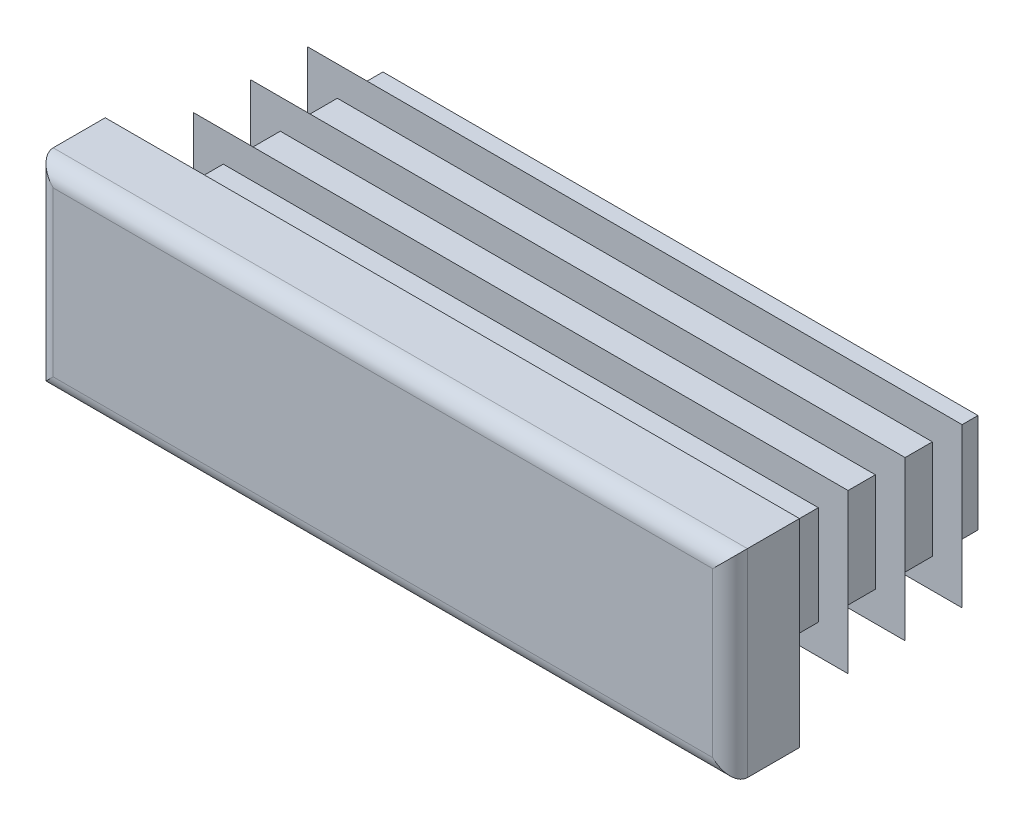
ISO-10303-21;
HEADER;
FILE_DESCRIPTION(('STEP AP214'),'2;1');
FILE_NAME('part.step','',(''),(''),'','','');
FILE_SCHEMA(('AUTOMOTIVE_DESIGN { 1 0 10303 214 1 1 1 1 }'));
ENDSEC;
DATA;
#1=APPLICATION_CONTEXT('core data for automotive mechanical design processes');
#2=APPLICATION_PROTOCOL_DEFINITION('international standard','automotive_design',2000,#1);
#3=PRODUCT_CONTEXT('',#1,'mechanical');
#4=PRODUCT('Part','Part','',(#3));
#5=PRODUCT_RELATED_PRODUCT_CATEGORY('part','',(#4));
#6=PRODUCT_DEFINITION_FORMATION('','',#4);
#7=PRODUCT_DEFINITION_CONTEXT('part definition',#1,'design');
#8=PRODUCT_DEFINITION('design','',#6,#7);
#9=PRODUCT_DEFINITION_SHAPE('','',#8);
#10=(LENGTH_UNIT() NAMED_UNIT(*) SI_UNIT(.MILLI.,.METRE.));
#11=(NAMED_UNIT(*) PLANE_ANGLE_UNIT() SI_UNIT($,.RADIAN.));
#12=(NAMED_UNIT(*) SI_UNIT($,.STERADIAN.) SOLID_ANGLE_UNIT());
#13=UNCERTAINTY_MEASURE_WITH_UNIT(LENGTH_MEASURE(1.E-05),#10,'distance_accuracy_value','');
#14=(GEOMETRIC_REPRESENTATION_CONTEXT(3) GLOBAL_UNCERTAINTY_ASSIGNED_CONTEXT((#13)) GLOBAL_UNIT_ASSIGNED_CONTEXT((#10,
#11,#12)) REPRESENTATION_CONTEXT('',''));
#15=CARTESIAN_POINT('',(0.,0.,0.));
#16=DIRECTION('',(0.,0.,1.));
#17=DIRECTION('',(1.,0.,0.));
#18=AXIS2_PLACEMENT_3D('',#15,#16,#17);
#19=CARTESIAN_POINT('',(16.625,-5.,3.5));
#20=DIRECTION('',(0.,0.,-1.));
#21=DIRECTION('',(0.,1.,0.));
#22=AXIS2_PLACEMENT_3D('',#19,#20,#21);
#23=PLANE('',#22);
#24=DIRECTION('',(0.,1.,0.));
#25=VECTOR('',#24,1.);
#26=CARTESIAN_POINT('',(-16.625,-5.,3.5));
#27=LINE('',#26,#25);
#28=CARTESIAN_POINT('',(-16.625,-4.125,3.5));
#29=VERTEX_POINT('',#28);
#30=CARTESIAN_POINT('',(-16.625,4.125,3.5));
#31=VERTEX_POINT('',#30);
#32=EDGE_CURVE('E310',#29,#31,#27,.T.);
#33=ORIENTED_EDGE('',*,*,#32,.F.);
#34=DIRECTION('',(-1.,0.,0.));
#35=VECTOR('',#34,1.);
#36=CARTESIAN_POINT('',(17.5,-4.125,3.5));
#37=LINE('',#36,#35);
#38=CARTESIAN_POINT('',(16.625,-4.125,3.5));
#39=VERTEX_POINT('',#38);
#40=EDGE_CURVE('E482',#39,#29,#37,.T.);
#41=ORIENTED_EDGE('',*,*,#40,.F.);
#42=DIRECTION('',(0.,1.,0.));
#43=VECTOR('',#42,1.);
#44=CARTESIAN_POINT('',(16.625,-5.,3.5));
#45=LINE('',#44,#43);
#46=CARTESIAN_POINT('',(16.625,4.125,3.5));
#47=VERTEX_POINT('',#46);
#48=EDGE_CURVE('E305',#39,#47,#45,.T.);
#49=ORIENTED_EDGE('',*,*,#48,.T.);
#50=DIRECTION('',(-1.,0.,0.));
#51=VECTOR('',#50,1.);
#52=CARTESIAN_POINT('',(17.5,4.125,3.5));
#53=LINE('',#52,#51);
#54=EDGE_CURVE('E630',#47,#31,#53,.T.);
#55=ORIENTED_EDGE('',*,*,#54,.T.);
#56=EDGE_LOOP('',(#33,#41,#49,#55));
#57=FACE_BOUND('',#56,.T.);
#58=ADVANCED_FACE('F14',(#57),#23,.F.);
#59=CARTESIAN_POINT('',(-16.625,-5.,2.625));
#60=DIRECTION('',(0.,1.,0.));
#61=DIRECTION('',(-1.,0.,0.));
#62=AXIS2_PLACEMENT_3D('',#59,#60,#61);
#63=CYLINDRICAL_SURFACE('',#62,0.875);
#64=DIRECTION('',(0.,1.,0.));
#65=VECTOR('',#64,1.);
#66=CARTESIAN_POINT('',(-17.5,-5.,2.625));
#67=LINE('',#66,#65);
#68=CARTESIAN_POINT('',(-17.5,-5.,2.625));
#69=VERTEX_POINT('',#68);
#70=CARTESIAN_POINT('',(-17.5,5.,2.625));
#71=VERTEX_POINT('',#70);
#72=EDGE_CURVE('E402',#69,#71,#67,.T.);
#73=ORIENTED_EDGE('',*,*,#72,.F.);
#74=CARTESIAN_POINT('',(-16.625,-4.125,2.625));
#75=DIRECTION('',(-0.707106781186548,0.707106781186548,0.));
#76=DIRECTION('',(0.707106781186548,0.707106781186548,0.));
#77=AXIS2_PLACEMENT_3D('',#74,#75,#76);
#78=ELLIPSE('',#77,1.23743686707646,0.875);
#79=EDGE_CURVE('E59',#69,#29,#78,.T.);
#80=ORIENTED_EDGE('',*,*,#79,.T.);
#81=ORIENTED_EDGE('',*,*,#32,.T.);
#82=CARTESIAN_POINT('',(-16.625,4.125,2.625));
#83=DIRECTION('',(0.707106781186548,0.707106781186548,0.));
#84=DIRECTION('',(-0.707106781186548,0.707106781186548,0.));
#85=AXIS2_PLACEMENT_3D('',#82,#83,#84);
#86=ELLIPSE('',#85,1.23743686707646,0.875);
#87=EDGE_CURVE('E306',#31,#71,#86,.F.);
#88=ORIENTED_EDGE('',*,*,#87,.T.);
#89=EDGE_LOOP('',(#73,#80,#81,#88));
#90=FACE_BOUND('',#89,.T.);
#91=ADVANCED_FACE('F16',(#90),#63,.T.);
#92=CARTESIAN_POINT('',(-17.5,-5.,2.625));
#93=DIRECTION('',(1.,0.,0.));
#94=DIRECTION('',(0.,1.,0.));
#95=AXIS2_PLACEMENT_3D('',#92,#93,#94);
#96=PLANE('',#95);
#97=DIRECTION('',(0.,0.,-1.));
#98=VECTOR('',#97,1.);
#99=CARTESIAN_POINT('',(-17.5,5.,2.625));
#100=LINE('',#99,#98);
#101=CARTESIAN_POINT('',(-17.5,5.,0.));
#102=VERTEX_POINT('',#101);
#103=EDGE_CURVE('E615',#71,#102,#100,.T.);
#104=ORIENTED_EDGE('',*,*,#103,.T.);
#105=DIRECTION('',(0.,1.,0.));
#106=VECTOR('',#105,1.);
#107=CARTESIAN_POINT('',(-17.5,-5.,0.));
#108=LINE('',#107,#106);
#109=CARTESIAN_POINT('',(-17.5,-5.,0.));
#110=VERTEX_POINT('',#109);
#111=EDGE_CURVE('E400',#110,#102,#108,.T.);
#112=ORIENTED_EDGE('',*,*,#111,.F.);
#113=DIRECTION('',(0.,0.,-1.));
#114=VECTOR('',#113,1.);
#115=CARTESIAN_POINT('',(-17.5,-5.,2.625));
#116=LINE('',#115,#114);
#117=EDGE_CURVE('E616',#69,#110,#116,.T.);
#118=ORIENTED_EDGE('',*,*,#117,.F.);
#119=ORIENTED_EDGE('',*,*,#72,.T.);
#120=EDGE_LOOP('',(#104,#112,#118,#119));
#121=FACE_BOUND('',#120,.T.);
#122=ADVANCED_FACE('F697',(#121),#96,.F.);
#123=CARTESIAN_POINT('',(-15.,-5.,0.));
#124=DIRECTION('',(1.,0.,0.));
#125=DIRECTION('',(0.,1.,0.));
#126=AXIS2_PLACEMENT_3D('',#123,#124,#125);
#127=PLANE('',#126);
#128=DIRECTION('',(0.,1.,0.));
#129=VECTOR('',#128,1.);
#130=CARTESIAN_POINT('',(-15.,-5.,0.));
#131=LINE('',#130,#129);
#132=CARTESIAN_POINT('',(-15.,-2.5,0.));
#133=VERTEX_POINT('',#132);
#134=CARTESIAN_POINT('',(-15.,2.5,0.));
#135=VERTEX_POINT('',#134);
#136=EDGE_CURVE('E397',#133,#135,#131,.T.);
#137=ORIENTED_EDGE('',*,*,#136,.T.);
#138=DIRECTION('',(0.,0.,-1.));
#139=VECTOR('',#138,1.);
#140=CARTESIAN_POINT('',(-15.,2.5,0.));
#141=LINE('',#140,#139);
#142=CARTESIAN_POINT('',(-15.,2.5,-0.575));
#143=VERTEX_POINT('',#142);
#144=EDGE_CURVE('E495',#135,#143,#141,.T.);
#145=ORIENTED_EDGE('',*,*,#144,.T.);
#146=DIRECTION('',(0.,1.,0.));
#147=VECTOR('',#146,1.);
#148=CARTESIAN_POINT('',(-15.,-5.,-0.575));
#149=LINE('',#148,#147);
#150=CARTESIAN_POINT('',(-15.,-2.5,-0.575));
#151=VERTEX_POINT('',#150);
#152=EDGE_CURVE('E394',#151,#143,#149,.T.);
#153=ORIENTED_EDGE('',*,*,#152,.F.);
#154=DIRECTION('',(0.,0.,1.));
#155=VECTOR('',#154,1.);
#156=CARTESIAN_POINT('',(-15.,-2.5,0.));
#157=LINE('',#156,#155);
#158=EDGE_CURVE('E489',#151,#133,#157,.T.);
#159=ORIENTED_EDGE('',*,*,#158,.T.);
#160=EDGE_LOOP('',(#137,#145,#153,#159));
#161=FACE_BOUND('',#160,.T.);
#162=ADVANCED_FACE('F787',(#161),#127,.F.);
#163=CARTESIAN_POINT('',(-16.5,-5.,-0.575));
#164=DIRECTION('',(0.342020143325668,0.,0.939692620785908));
#165=DIRECTION('',(-0.939692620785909,0.,0.342020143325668));
#166=AXIS2_PLACEMENT_3D('',#163,#164,#165);
#167=PLANE('',#166);
#168=DIRECTION('',(0.,1.,0.));
#169=VECTOR('',#168,1.);
#170=CARTESIAN_POINT('',(-16.5,-5.,-0.575));
#171=LINE('',#170,#169);
#172=CARTESIAN_POINT('',(-16.5,-4.,-0.575));
#173=VERTEX_POINT('',#172);
#174=CARTESIAN_POINT('',(-16.5,4.,-0.575));
#175=VERTEX_POINT('',#174);
#176=EDGE_CURVE('E392',#173,#175,#171,.T.);
#177=ORIENTED_EDGE('',*,*,#176,.T.);
#178=DIRECTION('',(0.844349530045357,-0.438895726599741,-0.307318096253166));
#179=VECTOR('',#178,1.);
#180=CARTESIAN_POINT('',(-13.1647673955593,2.26633487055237,-1.78892539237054));
#181=LINE('',#180,#179);
#182=CARTESIAN_POINT('',(-15.,3.22029495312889,-1.1209553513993));
#183=VERTEX_POINT('',#182);
#184=EDGE_CURVE('E519',#175,#183,#181,.T.);
#185=ORIENTED_EDGE('',*,*,#184,.T.);
#186=DIRECTION('',(0.,1.,0.));
#187=VECTOR('',#186,1.);
#188=CARTESIAN_POINT('',(-15.,-5.,-1.1209553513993));
#189=LINE('',#188,#187);
#190=CARTESIAN_POINT('',(-15.,-3.22029495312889,-1.1209553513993));
#191=VERTEX_POINT('',#190);
#192=EDGE_CURVE('E389',#191,#183,#189,.T.);
#193=ORIENTED_EDGE('',*,*,#192,.F.);
#194=DIRECTION('',(-0.844349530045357,-0.438895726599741,0.307318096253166));
#195=VECTOR('',#194,1.);
#196=CARTESIAN_POINT('',(-16.8705814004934,-4.19262945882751,-0.440119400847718));
#197=LINE('',#196,#195);
#198=EDGE_CURVE('E507',#191,#173,#197,.T.);
#199=ORIENTED_EDGE('',*,*,#198,.T.);
#200=EDGE_LOOP('',(#177,#185,#193,#199));
#201=FACE_BOUND('',#200,.T.);
#202=ADVANCED_FACE('F783',(#201),#167,.F.);
#203=CARTESIAN_POINT('',(-15.,-5.,-1.1209553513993));
#204=DIRECTION('',(1.,0.,0.));
#205=DIRECTION('',(0.,1.,0.));
#206=AXIS2_PLACEMENT_3D('',#203,#204,#205);
#207=PLANE('',#206);
#208=ORIENTED_EDGE('',*,*,#192,.T.);
#209=DIRECTION('',(0.,-0.819152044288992,-0.573576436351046));
#210=VECTOR('',#209,1.);
#211=CARTESIAN_POINT('',(-15.,-2.29560575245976,-4.98323060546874));
#212=LINE('',#211,#210);
#213=CARTESIAN_POINT('',(-15.,2.5,-1.62531130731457));
#214=VERTEX_POINT('',#213);
#215=EDGE_CURVE('E516',#183,#214,#212,.T.);
#216=ORIENTED_EDGE('',*,*,#215,.T.);
#217=DIRECTION('',(0.,0.,-1.));
#218=VECTOR('',#217,1.);
#219=CARTESIAN_POINT('',(-15.,2.5,-1.1209553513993));
#220=LINE('',#219,#218);
#221=CARTESIAN_POINT('',(-15.,2.5,-3.45));
#222=VERTEX_POINT('',#221);
#223=EDGE_CURVE('E525',#214,#222,#220,.T.);
#224=ORIENTED_EDGE('',*,*,#223,.T.);
#225=DIRECTION('',(0.,1.,0.));
#226=VECTOR('',#225,1.);
#227=CARTESIAN_POINT('',(-15.,-5.,-3.45));
#228=LINE('',#227,#226);
#229=CARTESIAN_POINT('',(-15.,-2.5,-3.45));
#230=VERTEX_POINT('',#229);
#231=EDGE_CURVE('E386',#230,#222,#228,.T.);
#232=ORIENTED_EDGE('',*,*,#231,.F.);
#233=DIRECTION('',(0.,0.,1.));
#234=VECTOR('',#233,1.);
#235=CARTESIAN_POINT('',(-15.,-2.5,-1.1209553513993));
#236=LINE('',#235,#234);
#237=CARTESIAN_POINT('',(-15.,-2.5,-1.62531130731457));
#238=VERTEX_POINT('',#237);
#239=EDGE_CURVE('E522',#230,#238,#236,.T.);
#240=ORIENTED_EDGE('',*,*,#239,.T.);
#241=DIRECTION('',(0.,-0.819152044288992,0.573576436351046));
#242=VECTOR('',#241,1.);
#243=CARTESIAN_POINT('',(-15.,-4.41449496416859,-0.284767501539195));
#244=LINE('',#243,#242);
#245=EDGE_CURVE('E504',#238,#191,#244,.T.);
#246=ORIENTED_EDGE('',*,*,#245,.T.);
#247=EDGE_LOOP('',(#208,#216,#224,#232,#240,#246));
#248=FACE_BOUND('',#247,.T.);
#249=ADVANCED_FACE('F779',(#248),#207,.F.);
#250=CARTESIAN_POINT('',(-16.5,-5.,-3.45));
#251=DIRECTION('',(0.342020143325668,0.,0.939692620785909));
#252=DIRECTION('',(-0.939692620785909,0.,0.342020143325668));
#253=AXIS2_PLACEMENT_3D('',#250,#251,#252);
#254=PLANE('',#253);
#255=DIRECTION('',(0.,1.,0.));
#256=VECTOR('',#255,1.);
#257=CARTESIAN_POINT('',(-16.5,-5.,-3.45));
#258=LINE('',#257,#256);
#259=CARTESIAN_POINT('',(-16.5,-4.,-3.45));
#260=VERTEX_POINT('',#259);
#261=CARTESIAN_POINT('',(-16.5,4.,-3.45));
#262=VERTEX_POINT('',#261);
#263=EDGE_CURVE('E384',#260,#262,#258,.T.);
#264=ORIENTED_EDGE('',*,*,#263,.T.);
#265=DIRECTION('',(0.844349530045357,-0.43889572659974,-0.307318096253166));
#266=VECTOR('',#265,1.);
#267=CARTESIAN_POINT('',(-13.1647673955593,2.26633487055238,-4.66392539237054));
#268=LINE('',#267,#266);
#269=CARTESIAN_POINT('',(-15.,3.22029495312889,-3.99595535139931));
#270=VERTEX_POINT('',#269);
#271=EDGE_CURVE('E549',#262,#270,#268,.T.);
#272=ORIENTED_EDGE('',*,*,#271,.T.);
#273=DIRECTION('',(0.,1.,0.));
#274=VECTOR('',#273,1.);
#275=CARTESIAN_POINT('',(-15.,-5.,-3.99595535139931));
#276=LINE('',#275,#274);
#277=CARTESIAN_POINT('',(-15.,-3.22029495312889,-3.99595535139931));
#278=VERTEX_POINT('',#277);
#279=EDGE_CURVE('E381',#278,#270,#276,.T.);
#280=ORIENTED_EDGE('',*,*,#279,.F.);
#281=DIRECTION('',(-0.844349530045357,-0.43889572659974,0.307318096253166));
#282=VECTOR('',#281,1.);
#283=CARTESIAN_POINT('',(-16.8705814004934,-4.19262945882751,-3.31511940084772));
#284=LINE('',#283,#282);
#285=EDGE_CURVE('E537',#278,#260,#284,.T.);
#286=ORIENTED_EDGE('',*,*,#285,.T.);
#287=EDGE_LOOP('',(#264,#272,#280,#286));
#288=FACE_BOUND('',#287,.T.);
#289=ADVANCED_FACE('F775',(#288),#254,.F.);
#290=CARTESIAN_POINT('',(-15.,-5.,-3.99595535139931));
#291=DIRECTION('',(1.,0.,0.));
#292=DIRECTION('',(0.,1.,0.));
#293=AXIS2_PLACEMENT_3D('',#290,#291,#292);
#294=PLANE('',#293);
#295=ORIENTED_EDGE('',*,*,#279,.T.);
#296=DIRECTION('',(0.,-0.819152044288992,-0.573576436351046));
#297=VECTOR('',#296,1.);
#298=CARTESIAN_POINT('',(-15.,-2.29560575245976,-7.85823060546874));
#299=LINE('',#298,#297);
#300=CARTESIAN_POINT('',(-15.,2.5,-4.50031130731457));
#301=VERTEX_POINT('',#300);
#302=EDGE_CURVE('E546',#270,#301,#299,.T.);
#303=ORIENTED_EDGE('',*,*,#302,.T.);
#304=DIRECTION('',(0.,0.,-1.));
#305=VECTOR('',#304,1.);
#306=CARTESIAN_POINT('',(-15.,2.5,-3.99595535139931));
#307=LINE('',#306,#305);
#308=CARTESIAN_POINT('',(-15.,2.5,-6.325));
#309=VERTEX_POINT('',#308);
#310=EDGE_CURVE('E555',#301,#309,#307,.T.);
#311=ORIENTED_EDGE('',*,*,#310,.T.);
#312=DIRECTION('',(0.,1.,0.));
#313=VECTOR('',#312,1.);
#314=CARTESIAN_POINT('',(-15.,-5.,-6.325));
#315=LINE('',#314,#313);
#316=CARTESIAN_POINT('',(-15.,-2.5,-6.325));
#317=VERTEX_POINT('',#316);
#318=EDGE_CURVE('E378',#317,#309,#315,.T.);
#319=ORIENTED_EDGE('',*,*,#318,.F.);
#320=DIRECTION('',(0.,0.,1.));
#321=VECTOR('',#320,1.);
#322=CARTESIAN_POINT('',(-15.,-2.5,-3.99595535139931));
#323=LINE('',#322,#321);
#324=CARTESIAN_POINT('',(-15.,-2.5,-4.50031130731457));
#325=VERTEX_POINT('',#324);
#326=EDGE_CURVE('E552',#317,#325,#323,.T.);
#327=ORIENTED_EDGE('',*,*,#326,.T.);
#328=DIRECTION('',(0.,-0.819152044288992,0.573576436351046));
#329=VECTOR('',#328,1.);
#330=CARTESIAN_POINT('',(-15.,-4.41449496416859,-3.1597675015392));
#331=LINE('',#330,#329);
#332=EDGE_CURVE('E534',#325,#278,#331,.T.);
#333=ORIENTED_EDGE('',*,*,#332,.T.);
#334=EDGE_LOOP('',(#295,#303,#311,#319,#327,#333));
#335=FACE_BOUND('',#334,.T.);
#336=ADVANCED_FACE('F771',(#335),#294,.F.);
#337=CARTESIAN_POINT('',(-16.5,-5.,-6.325));
#338=DIRECTION('',(0.342020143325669,0.,0.939692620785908));
#339=DIRECTION('',(-0.939692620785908,0.,0.342020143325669));
#340=AXIS2_PLACEMENT_3D('',#337,#338,#339);
#341=PLANE('',#340);
#342=DIRECTION('',(0.,1.,0.));
#343=VECTOR('',#342,1.);
#344=CARTESIAN_POINT('',(-16.5,-5.,-6.325));
#345=LINE('',#344,#343);
#346=CARTESIAN_POINT('',(-16.5,-4.,-6.325));
#347=VERTEX_POINT('',#346);
#348=CARTESIAN_POINT('',(-16.5,4.,-6.325));
#349=VERTEX_POINT('',#348);
#350=EDGE_CURVE('E376',#347,#349,#345,.T.);
#351=ORIENTED_EDGE('',*,*,#350,.T.);
#352=DIRECTION('',(0.844349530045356,-0.438895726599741,-0.307318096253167));
#353=VECTOR('',#352,1.);
#354=CARTESIAN_POINT('',(-13.1647673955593,2.26633487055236,-7.53892539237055));
#355=LINE('',#354,#353);
#356=CARTESIAN_POINT('',(-15.,3.22029495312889,-6.87095535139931));
#357=VERTEX_POINT('',#356);
#358=EDGE_CURVE('E579',#349,#357,#355,.T.);
#359=ORIENTED_EDGE('',*,*,#358,.T.);
#360=DIRECTION('',(0.,1.,0.));
#361=VECTOR('',#360,1.);
#362=CARTESIAN_POINT('',(-15.,-5.,-6.87095535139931));
#363=LINE('',#362,#361);
#364=CARTESIAN_POINT('',(-15.,-3.22029495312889,-6.87095535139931));
#365=VERTEX_POINT('',#364);
#366=EDGE_CURVE('E373',#365,#357,#363,.T.);
#367=ORIENTED_EDGE('',*,*,#366,.F.);
#368=DIRECTION('',(-0.844349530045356,-0.438895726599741,0.307318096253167));
#369=VECTOR('',#368,1.);
#370=CARTESIAN_POINT('',(-16.8705814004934,-4.19262945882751,-6.19011940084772));
#371=LINE('',#370,#369);
#372=EDGE_CURVE('E567',#365,#347,#371,.T.);
#373=ORIENTED_EDGE('',*,*,#372,.T.);
#374=EDGE_LOOP('',(#351,#359,#367,#373));
#375=FACE_BOUND('',#374,.T.);
#376=ADVANCED_FACE('F767',(#375),#341,.F.);
#377=CARTESIAN_POINT('',(-15.,-5.,-6.87095535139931));
#378=DIRECTION('',(1.,0.,0.));
#379=DIRECTION('',(0.,1.,0.));
#380=AXIS2_PLACEMENT_3D('',#377,#378,#379);
#381=PLANE('',#380);
#382=ORIENTED_EDGE('',*,*,#366,.T.);
#383=DIRECTION('',(0.,-0.819152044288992,-0.573576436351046));
#384=VECTOR('',#383,1.);
#385=CARTESIAN_POINT('',(-15.,-2.29560575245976,-10.7332306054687));
#386=LINE('',#385,#384);
#387=CARTESIAN_POINT('',(-15.,2.5,-7.37531130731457));
#388=VERTEX_POINT('',#387);
#389=EDGE_CURVE('E576',#357,#388,#386,.T.);
#390=ORIENTED_EDGE('',*,*,#389,.T.);
#391=DIRECTION('',(0.,0.,-1.));
#392=VECTOR('',#391,1.);
#393=CARTESIAN_POINT('',(-15.,2.5,-6.87095535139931));
#394=LINE('',#393,#392);
#395=CARTESIAN_POINT('',(-15.,2.5,-9.2));
#396=VERTEX_POINT('',#395);
#397=EDGE_CURVE('E585',#388,#396,#394,.T.);
#398=ORIENTED_EDGE('',*,*,#397,.T.);
#399=DIRECTION('',(0.,1.,0.));
#400=VECTOR('',#399,1.);
#401=CARTESIAN_POINT('',(-15.,-5.,-9.2));
#402=LINE('',#401,#400);
#403=CARTESIAN_POINT('',(-15.,-2.5,-9.2));
#404=VERTEX_POINT('',#403);
#405=EDGE_CURVE('E370',#404,#396,#402,.T.);
#406=ORIENTED_EDGE('',*,*,#405,.F.);
#407=DIRECTION('',(0.,0.,1.));
#408=VECTOR('',#407,1.);
#409=CARTESIAN_POINT('',(-15.,-2.5,-6.87095535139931));
#410=LINE('',#409,#408);
#411=CARTESIAN_POINT('',(-15.,-2.5,-7.37531130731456));
#412=VERTEX_POINT('',#411);
#413=EDGE_CURVE('E582',#404,#412,#410,.T.);
#414=ORIENTED_EDGE('',*,*,#413,.T.);
#415=DIRECTION('',(0.,-0.819152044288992,0.573576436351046));
#416=VECTOR('',#415,1.);
#417=CARTESIAN_POINT('',(-15.,-4.41449496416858,-6.0347675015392));
#418=LINE('',#417,#416);
#419=EDGE_CURVE('E564',#412,#365,#418,.T.);
#420=ORIENTED_EDGE('',*,*,#419,.T.);
#421=EDGE_LOOP('',(#382,#390,#398,#406,#414,#420));
#422=FACE_BOUND('',#421,.T.);
#423=ADVANCED_FACE('F764',(#422),#381,.F.);
#424=CARTESIAN_POINT('',(-16.5,-5.,-9.2));
#425=DIRECTION('',(0.34202014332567,0.,0.939692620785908));
#426=DIRECTION('',(-0.939692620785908,0.,0.34202014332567));
#427=AXIS2_PLACEMENT_3D('',#424,#425,#426);
#428=PLANE('',#427);
#429=DIRECTION('',(0.,1.,0.));
#430=VECTOR('',#429,1.);
#431=CARTESIAN_POINT('',(-16.5,-5.,-9.2));
#432=LINE('',#431,#430);
#433=CARTESIAN_POINT('',(-16.5,-4.,-9.2));
#434=VERTEX_POINT('',#433);
#435=CARTESIAN_POINT('',(-16.5,4.,-9.2));
#436=VERTEX_POINT('',#435);
#437=EDGE_CURVE('E368',#434,#436,#432,.T.);
#438=ORIENTED_EDGE('',*,*,#437,.T.);
#439=DIRECTION('',(0.844349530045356,-0.438895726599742,-0.307318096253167));
#440=VECTOR('',#439,1.);
#441=CARTESIAN_POINT('',(-13.1647673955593,2.26633487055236,-10.4139253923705));
#442=LINE('',#441,#440);
#443=CARTESIAN_POINT('',(-15.,3.22029495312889,-9.74595535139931));
#444=VERTEX_POINT('',#443);
#445=EDGE_CURVE('E607',#436,#444,#442,.T.);
#446=ORIENTED_EDGE('',*,*,#445,.T.);
#447=DIRECTION('',(0.,1.,0.));
#448=VECTOR('',#447,1.);
#449=CARTESIAN_POINT('',(-15.,-5.,-9.74595535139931));
#450=LINE('',#449,#448);
#451=CARTESIAN_POINT('',(-15.,-3.22029495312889,-9.74595535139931));
#452=VERTEX_POINT('',#451);
#453=EDGE_CURVE('E365',#452,#444,#450,.T.);
#454=ORIENTED_EDGE('',*,*,#453,.F.);
#455=DIRECTION('',(-0.844349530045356,-0.438895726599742,0.307318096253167));
#456=VECTOR('',#455,1.);
#457=CARTESIAN_POINT('',(-16.8705814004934,-4.19262945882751,-9.06511940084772));
#458=LINE('',#457,#456);
#459=EDGE_CURVE('E595',#452,#434,#458,.T.);
#460=ORIENTED_EDGE('',*,*,#459,.T.);
#461=EDGE_LOOP('',(#438,#446,#454,#460));
#462=FACE_BOUND('',#461,.T.);
#463=ADVANCED_FACE('F675',(#462),#428,.F.);
#464=CARTESIAN_POINT('',(-15.,-5.,-9.74595535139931));
#465=DIRECTION('',(1.,0.,0.));
#466=DIRECTION('',(0.,1.,0.));
#467=AXIS2_PLACEMENT_3D('',#464,#465,#466);
#468=PLANE('',#467);
#469=ORIENTED_EDGE('',*,*,#453,.T.);
#470=DIRECTION('',(0.,-0.819152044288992,-0.573576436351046));
#471=VECTOR('',#470,1.);
#472=CARTESIAN_POINT('',(-15.,-2.29560575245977,-13.6082306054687));
#473=LINE('',#472,#471);
#474=CARTESIAN_POINT('',(-15.,2.5,-10.2503113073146));
#475=VERTEX_POINT('',#474);
#476=EDGE_CURVE('E604',#444,#475,#473,.T.);
#477=ORIENTED_EDGE('',*,*,#476,.T.);
#478=DIRECTION('',(0.,0.,-1.));
#479=VECTOR('',#478,1.);
#480=CARTESIAN_POINT('',(-15.,2.5,-9.74595535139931));
#481=LINE('',#480,#479);
#482=CARTESIAN_POINT('',(-15.,2.5,-11.5));
#483=VERTEX_POINT('',#482);
#484=EDGE_CURVE('E613',#475,#483,#481,.T.);
#485=ORIENTED_EDGE('',*,*,#484,.T.);
#486=DIRECTION('',(0.,1.,0.));
#487=VECTOR('',#486,1.);
#488=CARTESIAN_POINT('',(-15.,-5.,-11.5));
#489=LINE('',#488,#487);
#490=CARTESIAN_POINT('',(-15.,-2.5,-11.5));
#491=VERTEX_POINT('',#490);
#492=EDGE_CURVE('E362',#491,#483,#489,.T.);
#493=ORIENTED_EDGE('',*,*,#492,.F.);
#494=DIRECTION('',(0.,0.,1.));
#495=VECTOR('',#494,1.);
#496=CARTESIAN_POINT('',(-15.,-2.5,-9.74595535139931));
#497=LINE('',#496,#495);
#498=CARTESIAN_POINT('',(-15.,-2.5,-10.2503113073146));
#499=VERTEX_POINT('',#498);
#500=EDGE_CURVE('E610',#491,#499,#497,.T.);
#501=ORIENTED_EDGE('',*,*,#500,.T.);
#502=DIRECTION('',(0.,-0.819152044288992,0.573576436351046));
#503=VECTOR('',#502,1.);
#504=CARTESIAN_POINT('',(-15.,-4.41449496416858,-8.9097675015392));
#505=LINE('',#504,#503);
#506=EDGE_CURVE('E592',#499,#452,#505,.T.);
#507=ORIENTED_EDGE('',*,*,#506,.T.);
#508=EDGE_LOOP('',(#469,#477,#485,#493,#501,#507));
#509=FACE_BOUND('',#508,.T.);
#510=ADVANCED_FACE('F677',(#509),#468,.F.);
#511=CARTESIAN_POINT('',(-15.,-5.,-11.5));
#512=DIRECTION('',(0.,0.,1.));
#513=DIRECTION('',(0.,-1.,0.));
#514=AXIS2_PLACEMENT_3D('',#511,#512,#513);
#515=PLANE('',#514);
#516=ORIENTED_EDGE('',*,*,#492,.T.);
#517=DIRECTION('',(-1.,0.,0.));
#518=VECTOR('',#517,1.);
#519=CARTESIAN_POINT('',(17.5,2.5,-11.5));
#520=LINE('',#519,#518);
#521=CARTESIAN_POINT('',(15.,2.5,-11.5));
#522=VERTEX_POINT('',#521);
#523=EDGE_CURVE('E438',#522,#483,#520,.T.);
#524=ORIENTED_EDGE('',*,*,#523,.F.);
#525=DIRECTION('',(0.,1.,0.));
#526=VECTOR('',#525,1.);
#527=CARTESIAN_POINT('',(15.,-5.,-11.5));
#528=LINE('',#527,#526);
#529=CARTESIAN_POINT('',(15.,-2.5,-11.5));
#530=VERTEX_POINT('',#529);
#531=EDGE_CURVE('E359',#530,#522,#528,.T.);
#532=ORIENTED_EDGE('',*,*,#531,.F.);
#533=DIRECTION('',(-1.,0.,0.));
#534=VECTOR('',#533,1.);
#535=CARTESIAN_POINT('',(17.5,-2.5,-11.5));
#536=LINE('',#535,#534);
#537=EDGE_CURVE('E436',#530,#491,#536,.T.);
#538=ORIENTED_EDGE('',*,*,#537,.T.);
#539=EDGE_LOOP('',(#516,#524,#532,#538));
#540=FACE_BOUND('',#539,.T.);
#541=ADVANCED_FACE('F435',(#540),#515,.F.);
#542=CARTESIAN_POINT('',(15.,-5.,-11.5));
#543=DIRECTION('',(-1.,0.,0.));
#544=DIRECTION('',(0.,-1.,0.));
#545=AXIS2_PLACEMENT_3D('',#542,#543,#544);
#546=PLANE('',#545);
#547=DIRECTION('',(0.,0.,1.));
#548=VECTOR('',#547,1.);
#549=CARTESIAN_POINT('',(15.,2.5,-11.5));
#550=LINE('',#549,#548);
#551=CARTESIAN_POINT('',(15.,2.5,-10.2503113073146));
#552=VERTEX_POINT('',#551);
#553=EDGE_CURVE('E9',#522,#552,#550,.T.);
#554=ORIENTED_EDGE('',*,*,#553,.T.);
#555=DIRECTION('',(0.,0.819152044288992,0.573576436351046));
#556=VECTOR('',#555,1.);
#557=CARTESIAN_POINT('',(15.,-3.11973715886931,-14.1852936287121));
#558=LINE('',#557,#556);
#559=CARTESIAN_POINT('',(15.,3.22029495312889,-9.7459553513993));
#560=VERTEX_POINT('',#559);
#561=EDGE_CURVE('E601',#552,#560,#558,.T.);
#562=ORIENTED_EDGE('',*,*,#561,.T.);
#563=DIRECTION('',(0.,1.,0.));
#564=VECTOR('',#563,1.);
#565=CARTESIAN_POINT('',(15.,-5.,-9.7459553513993));
#566=LINE('',#565,#564);
#567=CARTESIAN_POINT('',(15.,-3.22029495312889,-9.7459553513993));
#568=VERTEX_POINT('',#567);
#569=EDGE_CURVE('E356',#568,#560,#566,.T.);
#570=ORIENTED_EDGE('',*,*,#569,.F.);
#571=DIRECTION('',(0.,0.819152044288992,-0.573576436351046));
#572=VECTOR('',#571,1.);
#573=CARTESIAN_POINT('',(15.,-3.59036355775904,-9.48683052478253));
#574=LINE('',#573,#572);
#575=CARTESIAN_POINT('',(15.,-2.5,-10.2503113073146));
#576=VERTEX_POINT('',#575);
#577=EDGE_CURVE('E428',#568,#576,#574,.T.);
#578=ORIENTED_EDGE('',*,*,#577,.T.);
#579=DIRECTION('',(0.,0.,-1.));
#580=VECTOR('',#579,1.);
#581=CARTESIAN_POINT('',(15.,-2.5,-11.5));
#582=LINE('',#581,#580);
#583=EDGE_CURVE('E23',#576,#530,#582,.T.);
#584=ORIENTED_EDGE('',*,*,#583,.T.);
#585=ORIENTED_EDGE('',*,*,#531,.T.);
#586=EDGE_LOOP('',(#554,#562,#570,#578,#584,#585));
#587=FACE_BOUND('',#586,.T.);
#588=ADVANCED_FACE('F426',(#587),#546,.F.);
#589=CARTESIAN_POINT('',(15.,-5.,-9.7459553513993));
#590=DIRECTION('',(-0.342020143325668,0.,0.939692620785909));
#591=DIRECTION('',(-0.939692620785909,0.,-0.342020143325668));
#592=AXIS2_PLACEMENT_3D('',#589,#590,#591);
#593=PLANE('',#592);
#594=ORIENTED_EDGE('',*,*,#569,.T.);
#595=DIRECTION('',(0.844349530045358,0.43889572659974,0.307318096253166));
#596=VECTOR('',#595,1.);
#597=CARTESIAN_POINT('',(11.9537115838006,1.63682398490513,-10.8547136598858));
#598=LINE('',#597,#596);
#599=CARTESIAN_POINT('',(16.5,4.,-9.2));
#600=VERTEX_POINT('',#599);
#601=EDGE_CURVE('E598',#560,#600,#598,.T.);
#602=ORIENTED_EDGE('',*,*,#601,.T.);
#603=DIRECTION('',(0.,1.,0.));
#604=VECTOR('',#603,1.);
#605=CARTESIAN_POINT('',(16.5,-5.,-9.2));
#606=LINE('',#605,#604);
#607=CARTESIAN_POINT('',(16.5,-4.,-9.2));
#608=VERTEX_POINT('',#607);
#609=EDGE_CURVE('E353',#608,#600,#606,.T.);
#610=ORIENTED_EDGE('',*,*,#609,.F.);
#611=DIRECTION('',(-0.844349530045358,0.43889572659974,-0.307318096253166));
#612=VECTOR('',#611,1.);
#613=CARTESIAN_POINT('',(15.6595255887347,-3.56311857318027,-9.50590766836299));
#614=LINE('',#613,#612);
#615=EDGE_CURVE('E588',#608,#568,#614,.T.);
#616=ORIENTED_EDGE('',*,*,#615,.T.);
#617=EDGE_LOOP('',(#594,#602,#610,#616));
#618=FACE_BOUND('',#617,.T.);
#619=ADVANCED_FACE('F752',(#618),#593,.F.);
#620=CARTESIAN_POINT('',(16.5,-5.,-9.2));
#621=DIRECTION('',(0.,0.,-1.));
#622=DIRECTION('',(0.,1.,0.));
#623=AXIS2_PLACEMENT_3D('',#620,#621,#622);
#624=PLANE('',#623);
#625=ORIENTED_EDGE('',*,*,#609,.T.);
#626=DIRECTION('',(-1.,0.,0.));
#627=VECTOR('',#626,1.);
#628=CARTESIAN_POINT('',(17.5,4.,-9.2));
#629=LINE('',#628,#627);
#630=EDGE_CURVE('E444',#600,#436,#629,.T.);
#631=ORIENTED_EDGE('',*,*,#630,.T.);
#632=ORIENTED_EDGE('',*,*,#437,.F.);
#633=DIRECTION('',(-1.,0.,0.));
#634=VECTOR('',#633,1.);
#635=CARTESIAN_POINT('',(17.5,-4.,-9.2));
#636=LINE('',#635,#634);
#637=EDGE_CURVE('E451',#608,#434,#636,.T.);
#638=ORIENTED_EDGE('',*,*,#637,.F.);
#639=EDGE_LOOP('',(#625,#631,#632,#638));
#640=FACE_BOUND('',#639,.T.);
#641=ORIENTED_EDGE('',*,*,#405,.T.);
#642=DIRECTION('',(-1.,0.,0.));
#643=VECTOR('',#642,1.);
#644=CARTESIAN_POINT('',(17.5,2.5,-9.2));
#645=LINE('',#644,#643);
#646=CARTESIAN_POINT('',(15.,2.5,-9.2));
#647=VERTEX_POINT('',#646);
#648=EDGE_CURVE('E663',#647,#396,#645,.T.);
#649=ORIENTED_EDGE('',*,*,#648,.F.);
#650=DIRECTION('',(0.,1.,0.));
#651=VECTOR('',#650,1.);
#652=CARTESIAN_POINT('',(15.,-5.,-9.2));
#653=LINE('',#652,#651);
#654=CARTESIAN_POINT('',(15.,-2.5,-9.2));
#655=VERTEX_POINT('',#654);
#656=EDGE_CURVE('E350',#655,#647,#653,.T.);
#657=ORIENTED_EDGE('',*,*,#656,.F.);
#658=DIRECTION('',(-1.,0.,0.));
#659=VECTOR('',#658,1.);
#660=CARTESIAN_POINT('',(17.5,-2.5,-9.2));
#661=LINE('',#660,#659);
#662=EDGE_CURVE('E453',#655,#404,#661,.T.);
#663=ORIENTED_EDGE('',*,*,#662,.T.);
#664=EDGE_LOOP('',(#641,#649,#657,#663));
#665=FACE_BOUND('',#664,.T.);
#666=ADVANCED_FACE('F667',(#640,#665),#624,.F.);
#667=CARTESIAN_POINT('',(15.,-5.,-9.2));
#668=DIRECTION('',(-1.,0.,0.));
#669=DIRECTION('',(0.,-1.,0.));
#670=AXIS2_PLACEMENT_3D('',#667,#668,#669);
#671=PLANE('',#670);
#672=DIRECTION('',(0.,0.,1.));
#673=VECTOR('',#672,1.);
#674=CARTESIAN_POINT('',(15.,2.5,-9.2));
#675=LINE('',#674,#673);
#676=CARTESIAN_POINT('',(15.,2.5,-7.37531130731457));
#677=VERTEX_POINT('',#676);
#678=EDGE_CURVE('E420',#647,#677,#675,.T.);
#679=ORIENTED_EDGE('',*,*,#678,.T.);
#680=DIRECTION('',(0.,0.819152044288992,0.573576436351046));
#681=VECTOR('',#680,1.);
#682=CARTESIAN_POINT('',(15.,-3.38989878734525,-11.4994628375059));
#683=LINE('',#682,#681);
#684=CARTESIAN_POINT('',(15.,3.22029495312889,-6.87095535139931));
#685=VERTEX_POINT('',#684);
#686=EDGE_CURVE('E573',#677,#685,#683,.T.);
#687=ORIENTED_EDGE('',*,*,#686,.T.);
#688=DIRECTION('',(0.,1.,0.));
#689=VECTOR('',#688,1.);
#690=CARTESIAN_POINT('',(15.,-5.,-6.87095535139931));
#691=LINE('',#690,#689);
#692=CARTESIAN_POINT('',(15.,-3.22029495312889,-6.87095535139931));
#693=VERTEX_POINT('',#692);
#694=EDGE_CURVE('E347',#693,#685,#691,.T.);
#695=ORIENTED_EDGE('',*,*,#694,.F.);
#696=DIRECTION('',(0.,0.819152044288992,-0.573576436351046));
#697=VECTOR('',#696,1.);
#698=CARTESIAN_POINT('',(15.,-3.32020192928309,-6.8009997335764));
#699=LINE('',#698,#697);
#700=CARTESIAN_POINT('',(15.,-2.5,-7.37531130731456));
#701=VERTEX_POINT('',#700);
#702=EDGE_CURVE('E561',#693,#701,#699,.T.);
#703=ORIENTED_EDGE('',*,*,#702,.T.);
#704=DIRECTION('',(0.,0.,-1.));
#705=VECTOR('',#704,1.);
#706=CARTESIAN_POINT('',(15.,-2.5,-9.2));
#707=LINE('',#706,#705);
#708=EDGE_CURVE('E417',#701,#655,#707,.T.);
#709=ORIENTED_EDGE('',*,*,#708,.T.);
#710=ORIENTED_EDGE('',*,*,#656,.T.);
#711=EDGE_LOOP('',(#679,#687,#695,#703,#709,#710));
#712=FACE_BOUND('',#711,.T.);
#713=ADVANCED_FACE('F745',(#712),#671,.F.);
#714=CARTESIAN_POINT('',(15.,-5.,-6.87095535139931));
#715=DIRECTION('',(-0.342020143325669,0.,0.939692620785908));
#716=DIRECTION('',(-0.939692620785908,0.,-0.342020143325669));
#717=AXIS2_PLACEMENT_3D('',#714,#715,#716);
#718=PLANE('',#717);
#719=ORIENTED_EDGE('',*,*,#694,.T.);
#720=DIRECTION('',(0.844349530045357,0.438895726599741,0.307318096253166));
#721=VECTOR('',#720,1.);
#722=CARTESIAN_POINT('',(11.9537115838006,1.63682398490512,-7.97971365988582));
#723=LINE('',#722,#721);
#724=CARTESIAN_POINT('',(16.5,4.,-6.325));
#725=VERTEX_POINT('',#724);
#726=EDGE_CURVE('E570',#685,#725,#723,.T.);
#727=ORIENTED_EDGE('',*,*,#726,.T.);
#728=DIRECTION('',(0.,1.,0.));
#729=VECTOR('',#728,1.);
#730=CARTESIAN_POINT('',(16.5,-5.,-6.325));
#731=LINE('',#730,#729);
#732=CARTESIAN_POINT('',(16.5,-4.,-6.325));
#733=VERTEX_POINT('',#732);
#734=EDGE_CURVE('E344',#733,#725,#731,.T.);
#735=ORIENTED_EDGE('',*,*,#734,.F.);
#736=DIRECTION('',(-0.844349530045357,0.438895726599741,-0.307318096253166));
#737=VECTOR('',#736,1.);
#738=CARTESIAN_POINT('',(15.6595255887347,-3.56311857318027,-6.63090766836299));
#739=LINE('',#738,#737);
#740=EDGE_CURVE('E558',#733,#693,#739,.T.);
#741=ORIENTED_EDGE('',*,*,#740,.T.);
#742=EDGE_LOOP('',(#719,#727,#735,#741));
#743=FACE_BOUND('',#742,.T.);
#744=ADVANCED_FACE('F741',(#743),#718,.F.);
#745=CARTESIAN_POINT('',(16.5,-5.,-6.325));
#746=DIRECTION('',(0.,0.,-1.));
#747=DIRECTION('',(0.,1.,0.));
#748=AXIS2_PLACEMENT_3D('',#745,#746,#747);
#749=PLANE('',#748);
#750=ORIENTED_EDGE('',*,*,#734,.T.);
#751=DIRECTION('',(-1.,0.,0.));
#752=VECTOR('',#751,1.);
#753=CARTESIAN_POINT('',(17.5,4.,-6.325));
#754=LINE('',#753,#752);
#755=EDGE_CURVE('E657',#725,#349,#754,.T.);
#756=ORIENTED_EDGE('',*,*,#755,.T.);
#757=ORIENTED_EDGE('',*,*,#350,.F.);
#758=DIRECTION('',(-1.,0.,0.));
#759=VECTOR('',#758,1.);
#760=CARTESIAN_POINT('',(17.5,-4.,-6.325));
#761=LINE('',#760,#759);
#762=EDGE_CURVE('E459',#733,#347,#761,.T.);
#763=ORIENTED_EDGE('',*,*,#762,.F.);
#764=EDGE_LOOP('',(#750,#756,#757,#763));
#765=FACE_BOUND('',#764,.T.);
#766=ORIENTED_EDGE('',*,*,#318,.T.);
#767=DIRECTION('',(-1.,0.,0.));
#768=VECTOR('',#767,1.);
#769=CARTESIAN_POINT('',(17.5,2.5,-6.325));
#770=LINE('',#769,#768);
#771=CARTESIAN_POINT('',(15.,2.5,-6.325));
#772=VERTEX_POINT('',#771);
#773=EDGE_CURVE('E655',#772,#309,#770,.T.);
#774=ORIENTED_EDGE('',*,*,#773,.F.);
#775=DIRECTION('',(0.,1.,0.));
#776=VECTOR('',#775,1.);
#777=CARTESIAN_POINT('',(15.,-5.,-6.325));
#778=LINE('',#777,#776);
#779=CARTESIAN_POINT('',(15.,-2.5,-6.325));
#780=VERTEX_POINT('',#779);
#781=EDGE_CURVE('E341',#780,#772,#778,.T.);
#782=ORIENTED_EDGE('',*,*,#781,.F.);
#783=DIRECTION('',(-1.,0.,0.));
#784=VECTOR('',#783,1.);
#785=CARTESIAN_POINT('',(17.5,-2.5,-6.325));
#786=LINE('',#785,#784);
#787=EDGE_CURVE('E461',#780,#317,#786,.T.);
#788=ORIENTED_EDGE('',*,*,#787,.T.);
#789=EDGE_LOOP('',(#766,#774,#782,#788));
#790=FACE_BOUND('',#789,.T.);
#791=ADVANCED_FACE('F737',(#765,#790),#749,.F.);
#792=CARTESIAN_POINT('',(15.,-5.,-6.325));
#793=DIRECTION('',(-1.,0.,0.));
#794=DIRECTION('',(0.,-1.,0.));
#795=AXIS2_PLACEMENT_3D('',#792,#793,#794);
#796=PLANE('',#795);
#797=DIRECTION('',(0.,0.,1.));
#798=VECTOR('',#797,1.);
#799=CARTESIAN_POINT('',(15.,2.5,-6.325));
#800=LINE('',#799,#798);
#801=CARTESIAN_POINT('',(15.,2.5,-4.50031130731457));
#802=VERTEX_POINT('',#801);
#803=EDGE_CURVE('E414',#772,#802,#800,.T.);
#804=ORIENTED_EDGE('',*,*,#803,.T.);
#805=DIRECTION('',(0.,0.819152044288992,0.573576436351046));
#806=VECTOR('',#805,1.);
#807=CARTESIAN_POINT('',(15.,-3.38989878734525,-8.62446283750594));
#808=LINE('',#807,#806);
#809=CARTESIAN_POINT('',(15.,3.22029495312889,-3.99595535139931));
#810=VERTEX_POINT('',#809);
#811=EDGE_CURVE('E543',#802,#810,#808,.T.);
#812=ORIENTED_EDGE('',*,*,#811,.T.);
#813=DIRECTION('',(0.,1.,0.));
#814=VECTOR('',#813,1.);
#815=CARTESIAN_POINT('',(15.,-5.,-3.99595535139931));
#816=LINE('',#815,#814);
#817=CARTESIAN_POINT('',(15.,-3.22029495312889,-3.99595535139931));
#818=VERTEX_POINT('',#817);
#819=EDGE_CURVE('E338',#818,#810,#816,.T.);
#820=ORIENTED_EDGE('',*,*,#819,.F.);
#821=DIRECTION('',(0.,0.819152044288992,-0.573576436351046));
#822=VECTOR('',#821,1.);
#823=CARTESIAN_POINT('',(15.,-3.32020192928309,-3.9259997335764));
#824=LINE('',#823,#822);
#825=CARTESIAN_POINT('',(15.,-2.5,-4.50031130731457));
#826=VERTEX_POINT('',#825);
#827=EDGE_CURVE('E531',#818,#826,#824,.T.);
#828=ORIENTED_EDGE('',*,*,#827,.T.);
#829=DIRECTION('',(0.,0.,-1.));
#830=VECTOR('',#829,1.);
#831=CARTESIAN_POINT('',(15.,-2.5,-6.325));
#832=LINE('',#831,#830);
#833=EDGE_CURVE('E411',#826,#780,#832,.T.);
#834=ORIENTED_EDGE('',*,*,#833,.T.);
#835=ORIENTED_EDGE('',*,*,#781,.T.);
#836=EDGE_LOOP('',(#804,#812,#820,#828,#834,#835));
#837=FACE_BOUND('',#836,.T.);
#838=ADVANCED_FACE('F733',(#837),#796,.F.);
#839=CARTESIAN_POINT('',(15.,-5.,-3.99595535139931));
#840=DIRECTION('',(-0.342020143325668,0.,0.939692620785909));
#841=DIRECTION('',(-0.939692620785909,0.,-0.342020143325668));
#842=AXIS2_PLACEMENT_3D('',#839,#840,#841);
#843=PLANE('',#842);
#844=ORIENTED_EDGE('',*,*,#819,.T.);
#845=DIRECTION('',(0.844349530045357,0.43889572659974,0.307318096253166));
#846=VECTOR('',#845,1.);
#847=CARTESIAN_POINT('',(11.9537115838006,1.63682398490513,-5.10471365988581));
#848=LINE('',#847,#846);
#849=CARTESIAN_POINT('',(16.5,4.,-3.45));
#850=VERTEX_POINT('',#849);
#851=EDGE_CURVE('E540',#810,#850,#848,.T.);
#852=ORIENTED_EDGE('',*,*,#851,.T.);
#853=DIRECTION('',(0.,1.,0.));
#854=VECTOR('',#853,1.);
#855=CARTESIAN_POINT('',(16.5,-5.,-3.45));
#856=LINE('',#855,#854);
#857=CARTESIAN_POINT('',(16.5,-4.,-3.45));
#858=VERTEX_POINT('',#857);
#859=EDGE_CURVE('E335',#858,#850,#856,.T.);
#860=ORIENTED_EDGE('',*,*,#859,.F.);
#861=DIRECTION('',(-0.844349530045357,0.43889572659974,-0.307318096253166));
#862=VECTOR('',#861,1.);
#863=CARTESIAN_POINT('',(15.6595255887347,-3.56311857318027,-3.75590766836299));
#864=LINE('',#863,#862);
#865=EDGE_CURVE('E528',#858,#818,#864,.T.);
#866=ORIENTED_EDGE('',*,*,#865,.T.);
#867=EDGE_LOOP('',(#844,#852,#860,#866));
#868=FACE_BOUND('',#867,.T.);
#869=ADVANCED_FACE('F729',(#868),#843,.F.);
#870=CARTESIAN_POINT('',(16.5,-5.,-3.45));
#871=DIRECTION('',(0.,0.,-1.));
#872=DIRECTION('',(0.,1.,0.));
#873=AXIS2_PLACEMENT_3D('',#870,#871,#872);
#874=PLANE('',#873);
#875=ORIENTED_EDGE('',*,*,#859,.T.);
#876=DIRECTION('',(-1.,0.,0.));
#877=VECTOR('',#876,1.);
#878=CARTESIAN_POINT('',(17.5,4.,-3.45));
#879=LINE('',#878,#877);
#880=EDGE_CURVE('E649',#850,#262,#879,.T.);
#881=ORIENTED_EDGE('',*,*,#880,.T.);
#882=ORIENTED_EDGE('',*,*,#263,.F.);
#883=DIRECTION('',(-1.,0.,0.));
#884=VECTOR('',#883,1.);
#885=CARTESIAN_POINT('',(17.5,-4.,-3.45));
#886=LINE('',#885,#884);
#887=EDGE_CURVE('E467',#858,#260,#886,.T.);
#888=ORIENTED_EDGE('',*,*,#887,.F.);
#889=EDGE_LOOP('',(#875,#881,#882,#888));
#890=FACE_BOUND('',#889,.T.);
#891=ORIENTED_EDGE('',*,*,#231,.T.);
#892=DIRECTION('',(-1.,0.,0.));
#893=VECTOR('',#892,1.);
#894=CARTESIAN_POINT('',(17.5,2.5,-3.45));
#895=LINE('',#894,#893);
#896=CARTESIAN_POINT('',(15.,2.5,-3.45));
#897=VERTEX_POINT('',#896);
#898=EDGE_CURVE('E647',#897,#222,#895,.T.);
#899=ORIENTED_EDGE('',*,*,#898,.F.);
#900=DIRECTION('',(0.,1.,0.));
#901=VECTOR('',#900,1.);
#902=CARTESIAN_POINT('',(15.,-5.,-3.45));
#903=LINE('',#902,#901);
#904=CARTESIAN_POINT('',(15.,-2.5,-3.45));
#905=VERTEX_POINT('',#904);
#906=EDGE_CURVE('E332',#905,#897,#903,.T.);
#907=ORIENTED_EDGE('',*,*,#906,.F.);
#908=DIRECTION('',(-1.,0.,0.));
#909=VECTOR('',#908,1.);
#910=CARTESIAN_POINT('',(17.5,-2.5,-3.45));
#911=LINE('',#910,#909);
#912=EDGE_CURVE('E469',#905,#230,#911,.T.);
#913=ORIENTED_EDGE('',*,*,#912,.T.);
#914=EDGE_LOOP('',(#891,#899,#907,#913));
#915=FACE_BOUND('',#914,.T.);
#916=ADVANCED_FACE('F725',(#890,#915),#874,.F.);
#917=CARTESIAN_POINT('',(15.,-5.,-3.45));
#918=DIRECTION('',(-1.,0.,0.));
#919=DIRECTION('',(0.,-1.,0.));
#920=AXIS2_PLACEMENT_3D('',#917,#918,#919);
#921=PLANE('',#920);
#922=DIRECTION('',(0.,0.,1.));
#923=VECTOR('',#922,1.);
#924=CARTESIAN_POINT('',(15.,2.5,-3.45));
#925=LINE('',#924,#923);
#926=CARTESIAN_POINT('',(15.,2.5,-1.62531130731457));
#927=VERTEX_POINT('',#926);
#928=EDGE_CURVE('E408',#897,#927,#925,.T.);
#929=ORIENTED_EDGE('',*,*,#928,.T.);
#930=DIRECTION('',(0.,0.819152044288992,0.573576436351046));
#931=VECTOR('',#930,1.);
#932=CARTESIAN_POINT('',(15.,-3.38989878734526,-5.74946283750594));
#933=LINE('',#932,#931);
#934=CARTESIAN_POINT('',(15.,3.22029495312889,-1.1209553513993));
#935=VERTEX_POINT('',#934);
#936=EDGE_CURVE('E513',#927,#935,#933,.T.);
#937=ORIENTED_EDGE('',*,*,#936,.T.);
#938=DIRECTION('',(0.,1.,0.));
#939=VECTOR('',#938,1.);
#940=CARTESIAN_POINT('',(15.,-5.,-1.1209553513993));
#941=LINE('',#940,#939);
#942=CARTESIAN_POINT('',(15.,-3.22029495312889,-1.1209553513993));
#943=VERTEX_POINT('',#942);
#944=EDGE_CURVE('E329',#943,#935,#941,.T.);
#945=ORIENTED_EDGE('',*,*,#944,.F.);
#946=DIRECTION('',(0.,0.819152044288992,-0.573576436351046));
#947=VECTOR('',#946,1.);
#948=CARTESIAN_POINT('',(15.,-3.32020192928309,-1.0509997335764));
#949=LINE('',#948,#947);
#950=CARTESIAN_POINT('',(15.,-2.5,-1.62531130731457));
#951=VERTEX_POINT('',#950);
#952=EDGE_CURVE('E501',#943,#951,#949,.T.);
#953=ORIENTED_EDGE('',*,*,#952,.T.);
#954=DIRECTION('',(0.,0.,-1.));
#955=VECTOR('',#954,1.);
#956=CARTESIAN_POINT('',(15.,-2.5,-3.45));
#957=LINE('',#956,#955);
#958=EDGE_CURVE('E405',#951,#905,#957,.T.);
#959=ORIENTED_EDGE('',*,*,#958,.T.);
#960=ORIENTED_EDGE('',*,*,#906,.T.);
#961=EDGE_LOOP('',(#929,#937,#945,#953,#959,#960));
#962=FACE_BOUND('',#961,.T.);
#963=ADVANCED_FACE('F721',(#962),#921,.F.);
#964=CARTESIAN_POINT('',(15.,-5.,-1.1209553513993));
#965=DIRECTION('',(-0.342020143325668,0.,0.939692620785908));
#966=DIRECTION('',(-0.939692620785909,0.,-0.342020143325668));
#967=AXIS2_PLACEMENT_3D('',#964,#965,#966);
#968=PLANE('',#967);
#969=ORIENTED_EDGE('',*,*,#944,.T.);
#970=DIRECTION('',(0.844349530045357,0.438895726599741,0.307318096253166));
#971=VECTOR('',#970,1.);
#972=CARTESIAN_POINT('',(11.9537115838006,1.63682398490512,-2.22971365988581));
#973=LINE('',#972,#971);
#974=CARTESIAN_POINT('',(16.5,4.,-0.575));
#975=VERTEX_POINT('',#974);
#976=EDGE_CURVE('E510',#935,#975,#973,.T.);
#977=ORIENTED_EDGE('',*,*,#976,.T.);
#978=DIRECTION('',(0.,1.,0.));
#979=VECTOR('',#978,1.);
#980=CARTESIAN_POINT('',(16.5,-5.,-0.575));
#981=LINE('',#980,#979);
#982=CARTESIAN_POINT('',(16.5,-4.,-0.575));
#983=VERTEX_POINT('',#982);
#984=EDGE_CURVE('E326',#983,#975,#981,.T.);
#985=ORIENTED_EDGE('',*,*,#984,.F.);
#986=DIRECTION('',(-0.844349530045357,0.438895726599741,-0.307318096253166));
#987=VECTOR('',#986,1.);
#988=CARTESIAN_POINT('',(15.6595255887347,-3.56311857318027,-0.880907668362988));
#989=LINE('',#988,#987);
#990=EDGE_CURVE('E498',#983,#943,#989,.T.);
#991=ORIENTED_EDGE('',*,*,#990,.T.);
#992=EDGE_LOOP('',(#969,#977,#985,#991));
#993=FACE_BOUND('',#992,.T.);
#994=ADVANCED_FACE('F717',(#993),#968,.F.);
#995=CARTESIAN_POINT('',(16.5,-5.,-0.575));
#996=DIRECTION('',(0.,0.,-1.));
#997=DIRECTION('',(0.,1.,0.));
#998=AXIS2_PLACEMENT_3D('',#995,#996,#997);
#999=PLANE('',#998);
#1000=ORIENTED_EDGE('',*,*,#984,.T.);
#1001=DIRECTION('',(-1.,0.,0.));
#1002=VECTOR('',#1001,1.);
#1003=CARTESIAN_POINT('',(17.5,4.,-0.575));
#1004=LINE('',#1003,#1002);
#1005=EDGE_CURVE('E641',#975,#175,#1004,.T.);
#1006=ORIENTED_EDGE('',*,*,#1005,.T.);
#1007=ORIENTED_EDGE('',*,*,#176,.F.);
#1008=DIRECTION('',(-1.,0.,0.));
#1009=VECTOR('',#1008,1.);
#1010=CARTESIAN_POINT('',(17.5,-4.,-0.575));
#1011=LINE('',#1010,#1009);
#1012=EDGE_CURVE('E475',#983,#173,#1011,.T.);
#1013=ORIENTED_EDGE('',*,*,#1012,.F.);
#1014=EDGE_LOOP('',(#1000,#1006,#1007,#1013));
#1015=FACE_BOUND('',#1014,.T.);
#1016=ORIENTED_EDGE('',*,*,#152,.T.);
#1017=DIRECTION('',(-1.,0.,0.));
#1018=VECTOR('',#1017,1.);
#1019=CARTESIAN_POINT('',(17.5,2.5,-0.575));
#1020=LINE('',#1019,#1018);
#1021=CARTESIAN_POINT('',(15.,2.5,-0.575));
#1022=VERTEX_POINT('',#1021);
#1023=EDGE_CURVE('E639',#1022,#143,#1020,.T.);
#1024=ORIENTED_EDGE('',*,*,#1023,.F.);
#1025=DIRECTION('',(0.,1.,0.));
#1026=VECTOR('',#1025,1.);
#1027=CARTESIAN_POINT('',(15.,-5.,-0.575));
#1028=LINE('',#1027,#1026);
#1029=CARTESIAN_POINT('',(15.,-2.5,-0.575));
#1030=VERTEX_POINT('',#1029);
#1031=EDGE_CURVE('E323',#1030,#1022,#1028,.T.);
#1032=ORIENTED_EDGE('',*,*,#1031,.F.);
#1033=DIRECTION('',(-1.,0.,0.));
#1034=VECTOR('',#1033,1.);
#1035=CARTESIAN_POINT('',(17.5,-2.5,-0.575));
#1036=LINE('',#1035,#1034);
#1037=EDGE_CURVE('E477',#1030,#151,#1036,.T.);
#1038=ORIENTED_EDGE('',*,*,#1037,.T.);
#1039=EDGE_LOOP('',(#1016,#1024,#1032,#1038));
#1040=FACE_BOUND('',#1039,.T.);
#1041=ADVANCED_FACE('F713',(#1015,#1040),#999,.F.);
#1042=CARTESIAN_POINT('',(15.,-5.,-0.575));
#1043=DIRECTION('',(-1.,0.,0.));
#1044=DIRECTION('',(0.,-1.,0.));
#1045=AXIS2_PLACEMENT_3D('',#1042,#1043,#1044);
#1046=PLANE('',#1045);
#1047=ORIENTED_EDGE('',*,*,#1031,.T.);
#1048=DIRECTION('',(0.,0.,1.));
#1049=VECTOR('',#1048,1.);
#1050=CARTESIAN_POINT('',(15.,2.5,-0.575));
#1051=LINE('',#1050,#1049);
#1052=CARTESIAN_POINT('',(15.,2.5,0.));
#1053=VERTEX_POINT('',#1052);
#1054=EDGE_CURVE('E492',#1022,#1053,#1051,.T.);
#1055=ORIENTED_EDGE('',*,*,#1054,.T.);
#1056=DIRECTION('',(0.,1.,0.));
#1057=VECTOR('',#1056,1.);
#1058=CARTESIAN_POINT('',(15.,-5.,0.));
#1059=LINE('',#1058,#1057);
#1060=CARTESIAN_POINT('',(15.,-2.5,0.));
#1061=VERTEX_POINT('',#1060);
#1062=EDGE_CURVE('E316',#1061,#1053,#1059,.T.);
#1063=ORIENTED_EDGE('',*,*,#1062,.F.);
#1064=DIRECTION('',(0.,0.,-1.));
#1065=VECTOR('',#1064,1.);
#1066=CARTESIAN_POINT('',(15.,-2.5,-0.575));
#1067=LINE('',#1066,#1065);
#1068=EDGE_CURVE('E486',#1061,#1030,#1067,.T.);
#1069=ORIENTED_EDGE('',*,*,#1068,.T.);
#1070=EDGE_LOOP('',(#1047,#1055,#1063,#1069));
#1071=FACE_BOUND('',#1070,.T.);
#1072=ADVANCED_FACE('F709',(#1071),#1046,.F.);
#1073=CARTESIAN_POINT('',(15.,-5.,0.));
#1074=DIRECTION('',(0.,0.,1.));
#1075=DIRECTION('',(0.,-1.,0.));
#1076=AXIS2_PLACEMENT_3D('',#1073,#1074,#1075);
#1077=PLANE('',#1076);
#1078=DIRECTION('',(-1.,0.,0.));
#1079=VECTOR('',#1078,1.);
#1080=CARTESIAN_POINT('',(17.5,2.5,0.));
#1081=LINE('',#1080,#1079);
#1082=EDGE_CURVE('E634',#1053,#135,#1081,.T.);
#1083=ORIENTED_EDGE('',*,*,#1082,.T.);
#1084=ORIENTED_EDGE('',*,*,#136,.F.);
#1085=DIRECTION('',(-1.,0.,0.));
#1086=VECTOR('',#1085,1.);
#1087=CARTESIAN_POINT('',(17.5,-2.5,0.));
#1088=LINE('',#1087,#1086);
#1089=EDGE_CURVE('E296',#1061,#133,#1088,.T.);
#1090=ORIENTED_EDGE('',*,*,#1089,.F.);
#1091=ORIENTED_EDGE('',*,*,#1062,.T.);
#1092=EDGE_LOOP('',(#1083,#1084,#1090,#1091));
#1093=FACE_BOUND('',#1092,.T.);
#1094=ORIENTED_EDGE('',*,*,#111,.T.);
#1095=DIRECTION('',(1.,0.,0.));
#1096=VECTOR('',#1095,1.);
#1097=CARTESIAN_POINT('',(15.,5.,0.));
#1098=LINE('',#1097,#1096);
#1099=CARTESIAN_POINT('',(17.5,5.,0.));
#1100=VERTEX_POINT('',#1099);
#1101=EDGE_CURVE('E621',#102,#1100,#1098,.T.);
#1102=ORIENTED_EDGE('',*,*,#1101,.T.);
#1103=DIRECTION('',(0.,1.,0.));
#1104=VECTOR('',#1103,1.);
#1105=CARTESIAN_POINT('',(17.5,-5.,0.));
#1106=LINE('',#1105,#1104);
#1107=CARTESIAN_POINT('',(17.5,-5.,0.));
#1108=VERTEX_POINT('',#1107);
#1109=EDGE_CURVE('E45',#1108,#1100,#1106,.T.);
#1110=ORIENTED_EDGE('',*,*,#1109,.F.);
#1111=DIRECTION('',(1.,0.,0.));
#1112=VECTOR('',#1111,1.);
#1113=CARTESIAN_POINT('',(-17.5,-5.,0.));
#1114=LINE('',#1113,#1112);
#1115=EDGE_CURVE('E31',#110,#1108,#1114,.T.);
#1116=ORIENTED_EDGE('',*,*,#1115,.F.);
#1117=EDGE_LOOP('',(#1094,#1102,#1110,#1116));
#1118=FACE_BOUND('',#1117,.T.);
#1119=ADVANCED_FACE('F706',(#1093,#1118),#1077,.F.);
#1120=CARTESIAN_POINT('',(17.5,-5.,0.));
#1121=DIRECTION('',(-1.,0.,0.));
#1122=DIRECTION('',(0.,-1.,0.));
#1123=AXIS2_PLACEMENT_3D('',#1120,#1121,#1122);
#1124=PLANE('',#1123);
#1125=DIRECTION('',(0.,0.,1.));
#1126=VECTOR('',#1125,1.);
#1127=CARTESIAN_POINT('',(17.5,5.,0.));
#1128=LINE('',#1127,#1126);
#1129=CARTESIAN_POINT('',(17.5,5.,2.625));
#1130=VERTEX_POINT('',#1129);
#1131=EDGE_CURVE('E314',#1100,#1130,#1128,.T.);
#1132=ORIENTED_EDGE('',*,*,#1131,.T.);
#1133=DIRECTION('',(0.,1.,0.));
#1134=VECTOR('',#1133,1.);
#1135=CARTESIAN_POINT('',(17.5,-5.,2.625));
#1136=LINE('',#1135,#1134);
#1137=CARTESIAN_POINT('',(17.5,-5.,2.625));
#1138=VERTEX_POINT('',#1137);
#1139=EDGE_CURVE('E303',#1138,#1130,#1136,.T.);
#1140=ORIENTED_EDGE('',*,*,#1139,.F.);
#1141=DIRECTION('',(0.,0.,1.));
#1142=VECTOR('',#1141,1.);
#1143=CARTESIAN_POINT('',(17.5,-5.,0.));
#1144=LINE('',#1143,#1142);
#1145=EDGE_CURVE('E308',#1108,#1138,#1144,.T.);
#1146=ORIENTED_EDGE('',*,*,#1145,.F.);
#1147=ORIENTED_EDGE('',*,*,#1109,.T.);
#1148=EDGE_LOOP('',(#1132,#1140,#1146,#1147));
#1149=FACE_BOUND('',#1148,.T.);
#1150=ADVANCED_FACE('F312',(#1149),#1124,.F.);
#1151=CARTESIAN_POINT('',(16.625,-5.,2.625));
#1152=DIRECTION('',(0.,1.,0.));
#1153=DIRECTION('',(-1.,0.,0.));
#1154=AXIS2_PLACEMENT_3D('',#1151,#1152,#1153);
#1155=CYLINDRICAL_SURFACE('',#1154,0.875);
#1156=ORIENTED_EDGE('',*,*,#48,.F.);
#1157=CARTESIAN_POINT('',(16.625,-4.125,2.625));
#1158=DIRECTION('',(0.707106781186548,0.707106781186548,0.));
#1159=DIRECTION('',(-0.707106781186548,0.707106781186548,0.));
#1160=AXIS2_PLACEMENT_3D('',#1157,#1158,#1159);
#1161=ELLIPSE('',#1160,1.23743686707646,0.875);
#1162=EDGE_CURVE('E293',#39,#1138,#1161,.T.);
#1163=ORIENTED_EDGE('',*,*,#1162,.T.);
#1164=ORIENTED_EDGE('',*,*,#1139,.T.);
#1165=CARTESIAN_POINT('',(16.625,4.125,2.625));
#1166=DIRECTION('',(-0.707106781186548,0.707106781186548,0.));
#1167=DIRECTION('',(0.707106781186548,0.707106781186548,0.));
#1168=AXIS2_PLACEMENT_3D('',#1165,#1166,#1167);
#1169=ELLIPSE('',#1168,1.23743686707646,0.875);
#1170=EDGE_CURVE('E52',#1130,#47,#1169,.F.);
#1171=ORIENTED_EDGE('',*,*,#1170,.T.);
#1172=EDGE_LOOP('',(#1156,#1163,#1164,#1171));
#1173=FACE_BOUND('',#1172,.T.);
#1174=ADVANCED_FACE('F301',(#1173),#1155,.T.);
#1175=CARTESIAN_POINT('',(-16.625,-5.,2.625));
#1176=DIRECTION('',(0.,-1.,0.));
#1177=DIRECTION('',(1.,0.,0.));
#1178=AXIS2_PLACEMENT_3D('',#1175,#1176,#1177);
#1179=PLANE('',#1178);
#1180=DIRECTION('',(-1.,0.,0.));
#1181=VECTOR('',#1180,1.);
#1182=CARTESIAN_POINT('',(17.5,-5.,2.625));
#1183=LINE('',#1182,#1181);
#1184=EDGE_CURVE('E290',#1138,#69,#1183,.T.);
#1185=ORIENTED_EDGE('',*,*,#1184,.T.);
#1186=ORIENTED_EDGE('',*,*,#117,.T.);
#1187=ORIENTED_EDGE('',*,*,#1115,.T.);
#1188=ORIENTED_EDGE('',*,*,#1145,.T.);
#1189=EDGE_LOOP('',(#1185,#1186,#1187,#1188));
#1190=FACE_BOUND('',#1189,.T.);
#1191=ADVANCED_FACE('F309',(#1190),#1179,.T.);
#1192=CARTESIAN_POINT('',(-16.625,5.,2.625));
#1193=DIRECTION('',(0.,-1.,0.));
#1194=DIRECTION('',(1.,0.,0.));
#1195=AXIS2_PLACEMENT_3D('',#1192,#1193,#1194);
#1196=PLANE('',#1195);
#1197=ORIENTED_EDGE('',*,*,#103,.F.);
#1198=DIRECTION('',(-1.,0.,0.));
#1199=VECTOR('',#1198,1.);
#1200=CARTESIAN_POINT('',(17.5,5.,2.625));
#1201=LINE('',#1200,#1199);
#1202=EDGE_CURVE('E631',#1130,#71,#1201,.T.);
#1203=ORIENTED_EDGE('',*,*,#1202,.F.);
#1204=ORIENTED_EDGE('',*,*,#1131,.F.);
#1205=ORIENTED_EDGE('',*,*,#1101,.F.);
#1206=EDGE_LOOP('',(#1197,#1203,#1204,#1205));
#1207=FACE_BOUND('',#1206,.T.);
#1208=ADVANCED_FACE('F700',(#1207),#1196,.F.);
#1209=CARTESIAN_POINT('',(17.5,2.5,-0.575));
#1210=DIRECTION('',(0.,-1.,0.));
#1211=DIRECTION('',(1.,0.,0.));
#1212=AXIS2_PLACEMENT_3D('',#1209,#1210,#1211);
#1213=PLANE('',#1212);
#1214=ORIENTED_EDGE('',*,*,#1082,.F.);
#1215=ORIENTED_EDGE('',*,*,#1054,.F.);
#1216=ORIENTED_EDGE('',*,*,#1023,.T.);
#1217=ORIENTED_EDGE('',*,*,#144,.F.);
#1218=EDGE_LOOP('',(#1214,#1215,#1216,#1217));
#1219=FACE_BOUND('',#1218,.T.);
#1220=ADVANCED_FACE('F812',(#1219),#1213,.F.);
#1221=CARTESIAN_POINT('',(17.5,2.5,-1.62531130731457));
#1222=DIRECTION('',(0.,-0.573576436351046,0.819152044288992));
#1223=DIRECTION('',(0.,-0.819152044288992,-0.573576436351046));
#1224=AXIS2_PLACEMENT_3D('',#1221,#1222,#1223);
#1225=PLANE('',#1224);
#1226=ORIENTED_EDGE('',*,*,#1005,.F.);
#1227=ORIENTED_EDGE('',*,*,#976,.F.);
#1228=ORIENTED_EDGE('',*,*,#936,.F.);
#1229=DIRECTION('',(-1.,0.,0.));
#1230=VECTOR('',#1229,1.);
#1231=CARTESIAN_POINT('',(17.5,2.5,-1.62531130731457));
#1232=LINE('',#1231,#1230);
#1233=EDGE_CURVE('E644',#927,#214,#1232,.T.);
#1234=ORIENTED_EDGE('',*,*,#1233,.T.);
#1235=ORIENTED_EDGE('',*,*,#215,.F.);
#1236=ORIENTED_EDGE('',*,*,#184,.F.);
#1237=EDGE_LOOP('',(#1226,#1227,#1228,#1234,#1235,#1236));
#1238=FACE_BOUND('',#1237,.T.);
#1239=ADVANCED_FACE('F815',(#1238),#1225,.F.);
#1240=CARTESIAN_POINT('',(17.5,2.5,-3.45));
#1241=DIRECTION('',(0.,-1.,0.));
#1242=DIRECTION('',(1.,0.,0.));
#1243=AXIS2_PLACEMENT_3D('',#1240,#1241,#1242);
#1244=PLANE('',#1243);
#1245=ORIENTED_EDGE('',*,*,#1233,.F.);
#1246=ORIENTED_EDGE('',*,*,#928,.F.);
#1247=ORIENTED_EDGE('',*,*,#898,.T.);
#1248=ORIENTED_EDGE('',*,*,#223,.F.);
#1249=EDGE_LOOP('',(#1245,#1246,#1247,#1248));
#1250=FACE_BOUND('',#1249,.T.);
#1251=ADVANCED_FACE('F819',(#1250),#1244,.F.);
#1252=CARTESIAN_POINT('',(17.5,2.5,-4.50031130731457));
#1253=DIRECTION('',(0.,-0.573576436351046,0.819152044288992));
#1254=DIRECTION('',(0.,-0.819152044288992,-0.573576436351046));
#1255=AXIS2_PLACEMENT_3D('',#1252,#1253,#1254);
#1256=PLANE('',#1255);
#1257=ORIENTED_EDGE('',*,*,#880,.F.);
#1258=ORIENTED_EDGE('',*,*,#851,.F.);
#1259=ORIENTED_EDGE('',*,*,#811,.F.);
#1260=DIRECTION('',(-1.,0.,0.));
#1261=VECTOR('',#1260,1.);
#1262=CARTESIAN_POINT('',(17.5,2.5,-4.50031130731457));
#1263=LINE('',#1262,#1261);
#1264=EDGE_CURVE('E652',#802,#301,#1263,.T.);
#1265=ORIENTED_EDGE('',*,*,#1264,.T.);
#1266=ORIENTED_EDGE('',*,*,#302,.F.);
#1267=ORIENTED_EDGE('',*,*,#271,.F.);
#1268=EDGE_LOOP('',(#1257,#1258,#1259,#1265,#1266,#1267));
#1269=FACE_BOUND('',#1268,.T.);
#1270=ADVANCED_FACE('F823',(#1269),#1256,.F.);
#1271=CARTESIAN_POINT('',(17.5,2.5,-6.325));
#1272=DIRECTION('',(0.,-1.,0.));
#1273=DIRECTION('',(1.,0.,0.));
#1274=AXIS2_PLACEMENT_3D('',#1271,#1272,#1273);
#1275=PLANE('',#1274);
#1276=ORIENTED_EDGE('',*,*,#1264,.F.);
#1277=ORIENTED_EDGE('',*,*,#803,.F.);
#1278=ORIENTED_EDGE('',*,*,#773,.T.);
#1279=ORIENTED_EDGE('',*,*,#310,.F.);
#1280=EDGE_LOOP('',(#1276,#1277,#1278,#1279));
#1281=FACE_BOUND('',#1280,.T.);
#1282=ADVANCED_FACE('F827',(#1281),#1275,.F.);
#1283=CARTESIAN_POINT('',(17.5,2.5,-7.37531130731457));
#1284=DIRECTION('',(0.,-0.573576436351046,0.819152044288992));
#1285=DIRECTION('',(0.,-0.819152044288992,-0.573576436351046));
#1286=AXIS2_PLACEMENT_3D('',#1283,#1284,#1285);
#1287=PLANE('',#1286);
#1288=ORIENTED_EDGE('',*,*,#755,.F.);
#1289=ORIENTED_EDGE('',*,*,#726,.F.);
#1290=ORIENTED_EDGE('',*,*,#686,.F.);
#1291=DIRECTION('',(-1.,0.,0.));
#1292=VECTOR('',#1291,1.);
#1293=CARTESIAN_POINT('',(17.5,2.5,-7.37531130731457));
#1294=LINE('',#1293,#1292);
#1295=EDGE_CURVE('E660',#677,#388,#1294,.T.);
#1296=ORIENTED_EDGE('',*,*,#1295,.T.);
#1297=ORIENTED_EDGE('',*,*,#389,.F.);
#1298=ORIENTED_EDGE('',*,*,#358,.F.);
#1299=EDGE_LOOP('',(#1288,#1289,#1290,#1296,#1297,#1298));
#1300=FACE_BOUND('',#1299,.T.);
#1301=ADVANCED_FACE('F831',(#1300),#1287,.F.);
#1302=CARTESIAN_POINT('',(17.5,2.5,-9.2));
#1303=DIRECTION('',(0.,-1.,0.));
#1304=DIRECTION('',(1.,0.,0.));
#1305=AXIS2_PLACEMENT_3D('',#1302,#1303,#1304);
#1306=PLANE('',#1305);
#1307=ORIENTED_EDGE('',*,*,#1295,.F.);
#1308=ORIENTED_EDGE('',*,*,#678,.F.);
#1309=ORIENTED_EDGE('',*,*,#648,.T.);
#1310=ORIENTED_EDGE('',*,*,#397,.F.);
#1311=EDGE_LOOP('',(#1307,#1308,#1309,#1310));
#1312=FACE_BOUND('',#1311,.T.);
#1313=ADVANCED_FACE('F835',(#1312),#1306,.F.);
#1314=CARTESIAN_POINT('',(17.5,2.5,-10.2503113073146));
#1315=DIRECTION('',(0.,-0.573576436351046,0.819152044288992));
#1316=DIRECTION('',(0.,-0.819152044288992,-0.573576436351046));
#1317=AXIS2_PLACEMENT_3D('',#1314,#1315,#1316);
#1318=PLANE('',#1317);
#1319=ORIENTED_EDGE('',*,*,#630,.F.);
#1320=ORIENTED_EDGE('',*,*,#601,.F.);
#1321=ORIENTED_EDGE('',*,*,#561,.F.);
#1322=DIRECTION('',(-1.,0.,0.));
#1323=VECTOR('',#1322,1.);
#1324=CARTESIAN_POINT('',(17.5,2.5,-10.2503113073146));
#1325=LINE('',#1324,#1323);
#1326=EDGE_CURVE('E441',#552,#475,#1325,.T.);
#1327=ORIENTED_EDGE('',*,*,#1326,.T.);
#1328=ORIENTED_EDGE('',*,*,#476,.F.);
#1329=ORIENTED_EDGE('',*,*,#445,.F.);
#1330=EDGE_LOOP('',(#1319,#1320,#1321,#1327,#1328,#1329));
#1331=FACE_BOUND('',#1330,.T.);
#1332=ADVANCED_FACE('F672',(#1331),#1318,.F.);
#1333=CARTESIAN_POINT('',(17.5,2.5,-11.5));
#1334=DIRECTION('',(0.,-1.,0.));
#1335=DIRECTION('',(1.,0.,0.));
#1336=AXIS2_PLACEMENT_3D('',#1333,#1334,#1335);
#1337=PLANE('',#1336);
#1338=ORIENTED_EDGE('',*,*,#1326,.F.);
#1339=ORIENTED_EDGE('',*,*,#553,.F.);
#1340=ORIENTED_EDGE('',*,*,#523,.T.);
#1341=ORIENTED_EDGE('',*,*,#484,.F.);
#1342=EDGE_LOOP('',(#1338,#1339,#1340,#1341));
#1343=FACE_BOUND('',#1342,.T.);
#1344=ADVANCED_FACE('F802',(#1343),#1337,.F.);
#1345=CARTESIAN_POINT('',(17.5,4.125,2.625));
#1346=DIRECTION('',(-1.,0.,0.));
#1347=DIRECTION('',(0.,-1.,0.));
#1348=AXIS2_PLACEMENT_3D('',#1345,#1346,#1347);
#1349=CYLINDRICAL_SURFACE('',#1348,0.875);
#1350=ORIENTED_EDGE('',*,*,#54,.F.);
#1351=ORIENTED_EDGE('',*,*,#1170,.F.);
#1352=ORIENTED_EDGE('',*,*,#1202,.T.);
#1353=ORIENTED_EDGE('',*,*,#87,.F.);
#1354=EDGE_LOOP('',(#1350,#1351,#1352,#1353));
#1355=FACE_BOUND('',#1354,.T.);
#1356=ADVANCED_FACE('F799',(#1355),#1349,.T.);
#1357=CARTESIAN_POINT('',(17.5,-2.5,0.));
#1358=DIRECTION('',(0.,1.,0.));
#1359=DIRECTION('',(-1.,0.,0.));
#1360=AXIS2_PLACEMENT_3D('',#1357,#1358,#1359);
#1361=PLANE('',#1360);
#1362=ORIENTED_EDGE('',*,*,#1037,.F.);
#1363=ORIENTED_EDGE('',*,*,#1068,.F.);
#1364=ORIENTED_EDGE('',*,*,#1089,.T.);
#1365=ORIENTED_EDGE('',*,*,#158,.F.);
#1366=EDGE_LOOP('',(#1362,#1363,#1364,#1365));
#1367=FACE_BOUND('',#1366,.T.);
#1368=ADVANCED_FACE('F801',(#1367),#1361,.F.);
#1369=CARTESIAN_POINT('',(17.5,-4.,-0.575));
#1370=DIRECTION('',(0.,0.573576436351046,0.819152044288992));
#1371=DIRECTION('',(0.,-0.819152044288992,0.573576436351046));
#1372=AXIS2_PLACEMENT_3D('',#1369,#1370,#1371);
#1373=PLANE('',#1372);
#1374=ORIENTED_EDGE('',*,*,#245,.F.);
#1375=DIRECTION('',(-1.,0.,0.));
#1376=VECTOR('',#1375,1.);
#1377=CARTESIAN_POINT('',(17.5,-2.5,-1.62531130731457));
#1378=LINE('',#1377,#1376);
#1379=EDGE_CURVE('E472',#951,#238,#1378,.T.);
#1380=ORIENTED_EDGE('',*,*,#1379,.F.);
#1381=ORIENTED_EDGE('',*,*,#952,.F.);
#1382=ORIENTED_EDGE('',*,*,#990,.F.);
#1383=ORIENTED_EDGE('',*,*,#1012,.T.);
#1384=ORIENTED_EDGE('',*,*,#198,.F.);
#1385=EDGE_LOOP('',(#1374,#1380,#1381,#1382,#1383,#1384));
#1386=FACE_BOUND('',#1385,.T.);
#1387=ADVANCED_FACE('F808',(#1386),#1373,.F.);
#1388=CARTESIAN_POINT('',(17.5,-2.5,-1.62531130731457));
#1389=DIRECTION('',(0.,1.,0.));
#1390=DIRECTION('',(-1.,0.,0.));
#1391=AXIS2_PLACEMENT_3D('',#1388,#1389,#1390);
#1392=PLANE('',#1391);
#1393=ORIENTED_EDGE('',*,*,#912,.F.);
#1394=ORIENTED_EDGE('',*,*,#958,.F.);
#1395=ORIENTED_EDGE('',*,*,#1379,.T.);
#1396=ORIENTED_EDGE('',*,*,#239,.F.);
#1397=EDGE_LOOP('',(#1393,#1394,#1395,#1396));
#1398=FACE_BOUND('',#1397,.T.);
#1399=ADVANCED_FACE('F873',(#1398),#1392,.F.);
#1400=CARTESIAN_POINT('',(17.5,-4.,-3.45));
#1401=DIRECTION('',(0.,0.573576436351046,0.819152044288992));
#1402=DIRECTION('',(0.,-0.819152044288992,0.573576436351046));
#1403=AXIS2_PLACEMENT_3D('',#1400,#1401,#1402);
#1404=PLANE('',#1403);
#1405=ORIENTED_EDGE('',*,*,#332,.F.);
#1406=DIRECTION('',(-1.,0.,0.));
#1407=VECTOR('',#1406,1.);
#1408=CARTESIAN_POINT('',(17.5,-2.5,-4.50031130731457));
#1409=LINE('',#1408,#1407);
#1410=EDGE_CURVE('E464',#826,#325,#1409,.T.);
#1411=ORIENTED_EDGE('',*,*,#1410,.F.);
#1412=ORIENTED_EDGE('',*,*,#827,.F.);
#1413=ORIENTED_EDGE('',*,*,#865,.F.);
#1414=ORIENTED_EDGE('',*,*,#887,.T.);
#1415=ORIENTED_EDGE('',*,*,#285,.F.);
#1416=EDGE_LOOP('',(#1405,#1411,#1412,#1413,#1414,#1415));
#1417=FACE_BOUND('',#1416,.T.);
#1418=ADVANCED_FACE('F883',(#1417),#1404,.F.);
#1419=CARTESIAN_POINT('',(17.5,-2.5,-4.50031130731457));
#1420=DIRECTION('',(0.,1.,0.));
#1421=DIRECTION('',(-1.,0.,0.));
#1422=AXIS2_PLACEMENT_3D('',#1419,#1420,#1421);
#1423=PLANE('',#1422);
#1424=ORIENTED_EDGE('',*,*,#787,.F.);
#1425=ORIENTED_EDGE('',*,*,#833,.F.);
#1426=ORIENTED_EDGE('',*,*,#1410,.T.);
#1427=ORIENTED_EDGE('',*,*,#326,.F.);
#1428=EDGE_LOOP('',(#1424,#1425,#1426,#1427));
#1429=FACE_BOUND('',#1428,.T.);
#1430=ADVANCED_FACE('F893',(#1429),#1423,.F.);
#1431=CARTESIAN_POINT('',(17.5,-4.,-6.325));
#1432=DIRECTION('',(0.,0.573576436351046,0.819152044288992));
#1433=DIRECTION('',(0.,-0.819152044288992,0.573576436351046));
#1434=AXIS2_PLACEMENT_3D('',#1431,#1432,#1433);
#1435=PLANE('',#1434);
#1436=ORIENTED_EDGE('',*,*,#419,.F.);
#1437=DIRECTION('',(-1.,0.,0.));
#1438=VECTOR('',#1437,1.);
#1439=CARTESIAN_POINT('',(17.5,-2.5,-7.37531130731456));
#1440=LINE('',#1439,#1438);
#1441=EDGE_CURVE('E456',#701,#412,#1440,.T.);
#1442=ORIENTED_EDGE('',*,*,#1441,.F.);
#1443=ORIENTED_EDGE('',*,*,#702,.F.);
#1444=ORIENTED_EDGE('',*,*,#740,.F.);
#1445=ORIENTED_EDGE('',*,*,#762,.T.);
#1446=ORIENTED_EDGE('',*,*,#372,.F.);
#1447=EDGE_LOOP('',(#1436,#1442,#1443,#1444,#1445,#1446));
#1448=FACE_BOUND('',#1447,.T.);
#1449=ADVANCED_FACE('F903',(#1448),#1435,.F.);
#1450=CARTESIAN_POINT('',(17.5,-2.5,-7.37531130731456));
#1451=DIRECTION('',(0.,1.,0.));
#1452=DIRECTION('',(-1.,0.,0.));
#1453=AXIS2_PLACEMENT_3D('',#1450,#1451,#1452);
#1454=PLANE('',#1453);
#1455=ORIENTED_EDGE('',*,*,#662,.F.);
#1456=ORIENTED_EDGE('',*,*,#708,.F.);
#1457=ORIENTED_EDGE('',*,*,#1441,.T.);
#1458=ORIENTED_EDGE('',*,*,#413,.F.);
#1459=EDGE_LOOP('',(#1455,#1456,#1457,#1458));
#1460=FACE_BOUND('',#1459,.T.);
#1461=ADVANCED_FACE('F689',(#1460),#1454,.F.);
#1462=CARTESIAN_POINT('',(17.5,-4.,-9.2));
#1463=DIRECTION('',(0.,0.573576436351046,0.819152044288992));
#1464=DIRECTION('',(0.,-0.819152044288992,0.573576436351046));
#1465=AXIS2_PLACEMENT_3D('',#1462,#1463,#1464);
#1466=PLANE('',#1465);
#1467=ORIENTED_EDGE('',*,*,#506,.F.);
#1468=DIRECTION('',(-1.,0.,0.));
#1469=VECTOR('',#1468,1.);
#1470=CARTESIAN_POINT('',(17.5,-2.5,-10.2503113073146));
#1471=LINE('',#1470,#1469);
#1472=EDGE_CURVE('E446',#576,#499,#1471,.T.);
#1473=ORIENTED_EDGE('',*,*,#1472,.F.);
#1474=ORIENTED_EDGE('',*,*,#577,.F.);
#1475=ORIENTED_EDGE('',*,*,#615,.F.);
#1476=ORIENTED_EDGE('',*,*,#637,.T.);
#1477=ORIENTED_EDGE('',*,*,#459,.F.);
#1478=EDGE_LOOP('',(#1467,#1473,#1474,#1475,#1476,#1477));
#1479=FACE_BOUND('',#1478,.T.);
#1480=ADVANCED_FACE('F679',(#1479),#1466,.F.);
#1481=CARTESIAN_POINT('',(17.5,-2.5,-10.2503113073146));
#1482=DIRECTION('',(0.,1.,0.));
#1483=DIRECTION('',(-1.,0.,0.));
#1484=AXIS2_PLACEMENT_3D('',#1481,#1482,#1483);
#1485=PLANE('',#1484);
#1486=ORIENTED_EDGE('',*,*,#537,.F.);
#1487=ORIENTED_EDGE('',*,*,#583,.F.);
#1488=ORIENTED_EDGE('',*,*,#1472,.T.);
#1489=ORIENTED_EDGE('',*,*,#500,.F.);
#1490=EDGE_LOOP('',(#1486,#1487,#1488,#1489));
#1491=FACE_BOUND('',#1490,.T.);
#1492=ADVANCED_FACE('F680',(#1491),#1485,.F.);
#1493=CARTESIAN_POINT('',(17.5,-4.125,2.625));
#1494=DIRECTION('',(-1.,0.,0.));
#1495=DIRECTION('',(0.,-1.,0.));
#1496=AXIS2_PLACEMENT_3D('',#1493,#1494,#1495);
#1497=CYLINDRICAL_SURFACE('',#1496,0.875);
#1498=ORIENTED_EDGE('',*,*,#1184,.F.);
#1499=ORIENTED_EDGE('',*,*,#1162,.F.);
#1500=ORIENTED_EDGE('',*,*,#40,.T.);
#1501=ORIENTED_EDGE('',*,*,#79,.F.);
#1502=EDGE_LOOP('',(#1498,#1499,#1500,#1501));
#1503=FACE_BOUND('',#1502,.T.);
#1504=ADVANCED_FACE('F292',(#1503),#1497,.T.);
#1505=CLOSED_SHELL('',(#58,#91,#122,#162,#202,#249,#289,#336,#376,#423,#463,#510,#541,#588,#619,
#666,#713,#744,#791,#838,#869,#916,#963,#994,#1041,#1072,#1119,#1150,#1174,#1191,#1208,#1220,
#1239,#1251,#1270,#1282,#1301,#1313,#1332,#1344,#1356,#1368,#1387,#1399,#1418,#1430,#1449,#1461,
#1480,#1492,#1504));
#1506=MANIFOLD_SOLID_BREP('B1',#1505);
#1507=ADVANCED_BREP_SHAPE_REPRESENTATION('',(#18,#1506),#14);
#1508=SHAPE_DEFINITION_REPRESENTATION(#9,#1507);
ENDSEC;
END-ISO-10303-21;
